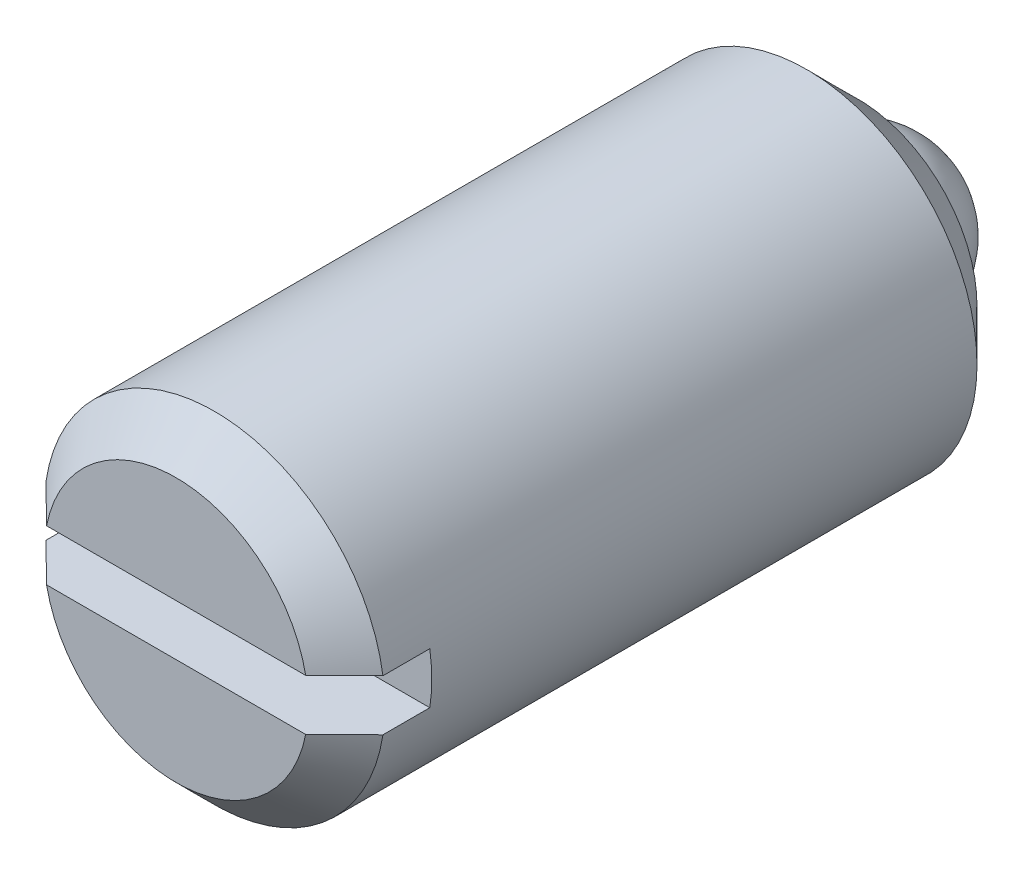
ISO-10303-21;
HEADER;
FILE_DESCRIPTION(('STEP AP214'),'2;1');
FILE_NAME('part.step','',(''),(''),'','','');
FILE_SCHEMA(('AUTOMOTIVE_DESIGN { 1 0 10303 214 1 1 1 1 }'));
ENDSEC;
DATA;
#1=APPLICATION_CONTEXT('core data for automotive mechanical design processes');
#2=APPLICATION_PROTOCOL_DEFINITION('international standard','automotive_design',2000,#1);
#3=PRODUCT_CONTEXT('',#1,'mechanical');
#4=PRODUCT('Part','Part','',(#3));
#5=PRODUCT_RELATED_PRODUCT_CATEGORY('part','',(#4));
#6=PRODUCT_DEFINITION_FORMATION('','',#4);
#7=PRODUCT_DEFINITION_CONTEXT('part definition',#1,'design');
#8=PRODUCT_DEFINITION('design','',#6,#7);
#9=PRODUCT_DEFINITION_SHAPE('','',#8);
#10=(LENGTH_UNIT() NAMED_UNIT(*) SI_UNIT(.MILLI.,.METRE.));
#11=(NAMED_UNIT(*) PLANE_ANGLE_UNIT() SI_UNIT($,.RADIAN.));
#12=(NAMED_UNIT(*) SI_UNIT($,.STERADIAN.) SOLID_ANGLE_UNIT());
#13=UNCERTAINTY_MEASURE_WITH_UNIT(LENGTH_MEASURE(1.E-05),#10,'distance_accuracy_value','');
#14=(GEOMETRIC_REPRESENTATION_CONTEXT(3) GLOBAL_UNCERTAINTY_ASSIGNED_CONTEXT((#13)) GLOBAL_UNIT_ASSIGNED_CONTEXT((#10,
#11,#12)) REPRESENTATION_CONTEXT('',''));
#15=CARTESIAN_POINT('',(0.,0.,0.));
#16=DIRECTION('',(0.,0.,1.));
#17=DIRECTION('',(1.,0.,0.));
#18=AXIS2_PLACEMENT_3D('',#15,#16,#17);
#19=CARTESIAN_POINT('',(0.,4.,18.));
#20=DIRECTION('',(0.,0.,1.));
#21=DIRECTION('',(1.,0.,0.));
#22=AXIS2_PLACEMENT_3D('',#19,#20,#21);
#23=PLANE('',#22);
#24=DIRECTION('',(1.,0.,0.));
#25=VECTOR('',#24,1.);
#26=CARTESIAN_POINT('',(-3.95474398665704,0.6,18.));
#27=LINE('',#26,#25);
#28=CARTESIAN_POINT('',(-3.04138126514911,0.6,18.));
#29=VERTEX_POINT('',#28);
#30=CARTESIAN_POINT('',(3.04138126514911,0.6,18.));
#31=VERTEX_POINT('',#30);
#32=EDGE_CURVE('E75',#29,#31,#27,.T.);
#33=ORIENTED_EDGE('',*,*,#32,.T.);
#34=CARTESIAN_POINT('',(0.,0.,18.));
#35=DIRECTION('',(0.,0.,1.));
#36=DIRECTION('',(0.,1.,0.));
#37=AXIS2_PLACEMENT_3D('',#34,#35,#36);
#38=CIRCLE('',#37,3.1);
#39=EDGE_CURVE('E9',#31,#29,#38,.T.);
#40=ORIENTED_EDGE('',*,*,#39,.T.);
#41=EDGE_LOOP('',(#33,#40));
#42=FACE_BOUND('',#41,.T.);
#43=ADVANCED_FACE('F14',(#42),#23,.T.);
#44=CARTESIAN_POINT('',(0.,0.,-8.));
#45=DIRECTION('',(0.,0.,-1.));
#46=DIRECTION('',(-1.,0.,0.));
#47=AXIS2_PLACEMENT_3D('',#44,#45,#46);
#48=CYLINDRICAL_SURFACE('',#47,4.);
#49=CARTESIAN_POINT('',(0.,0.,3.2));
#50=DIRECTION('',(0.,0.,-1.));
#51=DIRECTION('',(0.,-1.,0.));
#52=AXIS2_PLACEMENT_3D('',#49,#50,#51);
#53=CIRCLE('',#52,4.);
#54=CARTESIAN_POINT('',(0.,-4.,3.2));
#55=VERTEX_POINT('',#54);
#56=EDGE_CURVE('E104',#55,#55,#53,.F.);
#57=ORIENTED_EDGE('',*,*,#56,.T.);
#58=EDGE_LOOP('',(#57));
#59=FACE_BOUND('',#58,.T.);
#60=DIRECTION('',(0.,0.,1.));
#61=VECTOR('',#60,1.);
#62=CARTESIAN_POINT('',(3.95474398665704,-0.6,16.));
#63=LINE('',#62,#61);
#64=CARTESIAN_POINT('',(3.95474398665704,-0.6,16.));
#65=VERTEX_POINT('',#64);
#66=CARTESIAN_POINT('',(3.95474398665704,-0.6,17.1));
#67=VERTEX_POINT('',#66);
#68=EDGE_CURVE('E83',#65,#67,#63,.T.);
#69=ORIENTED_EDGE('',*,*,#68,.T.);
#70=CARTESIAN_POINT('',(0.,0.,17.1));
#71=DIRECTION('',(0.,0.,1.));
#72=DIRECTION('',(0.,1.,0.));
#73=AXIS2_PLACEMENT_3D('',#70,#71,#72);
#74=CIRCLE('',#73,4.);
#75=CARTESIAN_POINT('',(-3.95474398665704,-0.6,17.1));
#76=VERTEX_POINT('',#75);
#77=EDGE_CURVE('E89',#67,#76,#74,.F.);
#78=ORIENTED_EDGE('',*,*,#77,.T.);
#79=DIRECTION('',(0.,0.,1.));
#80=VECTOR('',#79,1.);
#81=CARTESIAN_POINT('',(-3.95474398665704,-0.6,16.));
#82=LINE('',#81,#80);
#83=CARTESIAN_POINT('',(-3.95474398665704,-0.6,16.));
#84=VERTEX_POINT('',#83);
#85=EDGE_CURVE('E81',#84,#76,#82,.T.);
#86=ORIENTED_EDGE('',*,*,#85,.F.);
#87=CARTESIAN_POINT('',(0.,0.,16.));
#88=DIRECTION('',(0.,0.,1.));
#89=DIRECTION('',(1.,0.,0.));
#90=AXIS2_PLACEMENT_3D('',#87,#88,#89);
#91=CIRCLE('',#90,4.);
#92=CARTESIAN_POINT('',(-3.95474398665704,0.6,16.));
#93=VERTEX_POINT('',#92);
#94=EDGE_CURVE('E65',#93,#84,#91,.T.);
#95=ORIENTED_EDGE('',*,*,#94,.F.);
#96=DIRECTION('',(0.,0.,1.));
#97=VECTOR('',#96,1.);
#98=CARTESIAN_POINT('',(-3.95474398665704,0.6,16.));
#99=LINE('',#98,#97);
#100=CARTESIAN_POINT('',(-3.95474398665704,0.6,17.1));
#101=VERTEX_POINT('',#100);
#102=EDGE_CURVE('E96',#93,#101,#99,.T.);
#103=ORIENTED_EDGE('',*,*,#102,.T.);
#104=CARTESIAN_POINT('',(0.,0.,17.1));
#105=DIRECTION('',(0.,0.,1.));
#106=DIRECTION('',(0.,1.,0.));
#107=AXIS2_PLACEMENT_3D('',#104,#105,#106);
#108=CIRCLE('',#107,4.);
#109=CARTESIAN_POINT('',(3.95474398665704,0.6,17.1));
#110=VERTEX_POINT('',#109);
#111=EDGE_CURVE('E107',#101,#110,#108,.F.);
#112=ORIENTED_EDGE('',*,*,#111,.T.);
#113=DIRECTION('',(0.,0.,1.));
#114=VECTOR('',#113,1.);
#115=CARTESIAN_POINT('',(3.95474398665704,0.6,16.));
#116=LINE('',#115,#114);
#117=CARTESIAN_POINT('',(3.95474398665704,0.6,16.));
#118=VERTEX_POINT('',#117);
#119=EDGE_CURVE('E91',#118,#110,#116,.T.);
#120=ORIENTED_EDGE('',*,*,#119,.F.);
#121=EDGE_CURVE('E77',#65,#118,#91,.T.);
#122=ORIENTED_EDGE('',*,*,#121,.F.);
#123=EDGE_LOOP('',(#69,#78,#86,#95,#103,#112,#120,#122));
#124=FACE_BOUND('',#123,.T.);
#125=ADVANCED_FACE('F87',(#59,#124),#48,.T.);
#126=CARTESIAN_POINT('',(0.,0.,2.));
#127=DIRECTION('',(-1.,0.,0.));
#128=DIRECTION('',(0.,0.,1.));
#129=AXIS2_PLACEMENT_3D('',#126,#127,#128);
#130=SPHERICAL_SURFACE('',#129,2.);
#131=CARTESIAN_POINT('',(0.,0.,2.));
#132=DIRECTION('',(0.,0.,-1.));
#133=DIRECTION('',(-1.,0.,0.));
#134=AXIS2_PLACEMENT_3D('',#131,#132,#133);
#135=SPHERICAL_SURFACE('',#134,2.);
#136=CARTESIAN_POINT('',(0.,0.,2.));
#137=DIRECTION('',(0.,0.,-1.));
#138=DIRECTION('',(-1.,0.,0.));
#139=AXIS2_PLACEMENT_3D('',#136,#137,#138);
#140=CIRCLE('',#139,2.);
#141=CARTESIAN_POINT('',(-2.,0.,2.));
#142=VERTEX_POINT('',#141);
#143=EDGE_CURVE('E98',#142,#142,#140,.T.);
#144=ORIENTED_EDGE('',*,*,#143,.T.);
#145=EDGE_LOOP('',(#144));
#146=FACE_BOUND('',#145,.T.);
#147=ADVANCED_FACE('F177',(#146),#135,.T.);
#148=DIRECTION('',(1.,0.,0.));
#149=VECTOR('',#148,1.);
#150=CARTESIAN_POINT('',(-3.95474398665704,-0.6,18.));
#151=LINE('',#150,#149);
#152=CARTESIAN_POINT('',(-3.04138126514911,-0.6,18.));
#153=VERTEX_POINT('',#152);
#154=CARTESIAN_POINT('',(3.04138126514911,-0.6,18.));
#155=VERTEX_POINT('',#154);
#156=EDGE_CURVE('E156',#153,#155,#151,.T.);
#157=ORIENTED_EDGE('',*,*,#156,.F.);
#158=CARTESIAN_POINT('',(0.,0.,18.));
#159=DIRECTION('',(0.,0.,1.));
#160=DIRECTION('',(0.,1.,0.));
#161=AXIS2_PLACEMENT_3D('',#158,#159,#160);
#162=CIRCLE('',#161,3.1);
#163=EDGE_CURVE('E150',#153,#155,#162,.T.);
#164=ORIENTED_EDGE('',*,*,#163,.T.);
#165=EDGE_LOOP('',(#157,#164));
#166=FACE_BOUND('',#165,.T.);
#167=ADVANCED_FACE('F159',(#166),#23,.T.);
#168=CARTESIAN_POINT('',(0.,2.,2.));
#169=DIRECTION('',(0.,0.,-1.));
#170=DIRECTION('',(-1.,0.,0.));
#171=AXIS2_PLACEMENT_3D('',#168,#169,#170);
#172=PLANE('',#171);
#173=CARTESIAN_POINT('',(0.,0.,2.));
#174=DIRECTION('',(0.,0.,-1.));
#175=DIRECTION('',(0.,-1.,0.));
#176=AXIS2_PLACEMENT_3D('',#173,#174,#175);
#177=CIRCLE('',#176,2.8);
#178=CARTESIAN_POINT('',(0.,-2.8,2.));
#179=VERTEX_POINT('',#178);
#180=EDGE_CURVE('E101',#179,#179,#177,.T.);
#181=ORIENTED_EDGE('',*,*,#180,.T.);
#182=EDGE_LOOP('',(#181));
#183=FACE_BOUND('',#182,.T.);
#184=ORIENTED_EDGE('',*,*,#143,.F.);
#185=EDGE_LOOP('',(#184));
#186=FACE_BOUND('',#185,.T.);
#187=ADVANCED_FACE('F137',(#183,#186),#172,.T.);
#188=CARTESIAN_POINT('',(-3.95474398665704,0.6,16.));
#189=DIRECTION('',(0.,-1.,0.));
#190=DIRECTION('',(1.,0.,0.));
#191=AXIS2_PLACEMENT_3D('',#188,#189,#190);
#192=PLANE('',#191);
#193=ORIENTED_EDGE('',*,*,#119,.T.);
#194=CARTESIAN_POINT('',(3.95474398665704,0.6,17.1));
#195=CARTESIAN_POINT('',(3.87875606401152,0.6,17.1751274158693));
#196=CARTESIAN_POINT('',(3.80274454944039,0.6,17.2502309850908));
#197=CARTESIAN_POINT('',(3.65066332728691,0.6,17.4003790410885));
#198=CARTESIAN_POINT('',(3.57459361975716,0.6,17.4754235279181));
#199=CARTESIAN_POINT('',(3.42238484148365,0.6,17.625442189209));
#200=CARTESIAN_POINT('',(3.34624577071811,0.6,17.7004163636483));
#201=CARTESIAN_POINT('',(3.19388188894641,0.6,17.8502776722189));
#202=CARTESIAN_POINT('',(3.11765707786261,0.6,17.9251648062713));
#203=CARTESIAN_POINT('',(3.04138126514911,0.6,18.));
#204=B_SPLINE_CURVE_WITH_KNOTS('',3,(#194,#195,#196,#197,#198,#199,#200,#201,#202,#203),
.UNSPECIFIED.,.F.,.F.,(4,2,2,2,4),(0.,0.32056924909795,0.641138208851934,0.96170726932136,
1.28227662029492),.UNSPECIFIED.);
#205=EDGE_CURVE('E23',#110,#31,#204,.T.);
#206=ORIENTED_EDGE('',*,*,#205,.T.);
#207=ORIENTED_EDGE('',*,*,#32,.F.);
#208=CARTESIAN_POINT('',(-3.04138126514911,0.6,18.));
#209=CARTESIAN_POINT('',(-3.11765707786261,0.6,17.9251648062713));
#210=CARTESIAN_POINT('',(-3.19388188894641,0.6,17.8502776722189));
#211=CARTESIAN_POINT('',(-3.34624577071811,0.6,17.7004163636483));
#212=CARTESIAN_POINT('',(-3.42238484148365,0.6,17.625442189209));
#213=CARTESIAN_POINT('',(-3.57459361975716,0.6,17.4754235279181));
#214=CARTESIAN_POINT('',(-3.65066332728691,0.6,17.4003790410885));
#215=CARTESIAN_POINT('',(-3.80274454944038,0.6,17.2502309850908));
#216=CARTESIAN_POINT('',(-3.87875606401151,0.6,17.1751274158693));
#217=CARTESIAN_POINT('',(-3.95474398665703,0.6,17.1));
#218=B_SPLINE_CURVE_WITH_KNOTS('',3,(#208,#209,#210,#211,#212,#213,#214,#215,#216,#217),
.UNSPECIFIED.,.F.,.F.,(4,2,2,2,4),(0.,0.320569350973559,0.641138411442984,0.961707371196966,
1.28227662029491),.UNSPECIFIED.);
#219=EDGE_CURVE('E141',#29,#101,#218,.T.);
#220=ORIENTED_EDGE('',*,*,#219,.T.);
#221=ORIENTED_EDGE('',*,*,#102,.F.);
#222=DIRECTION('',(1.,0.,0.));
#223=VECTOR('',#222,1.);
#224=CARTESIAN_POINT('',(-3.95474398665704,0.6,16.));
#225=LINE('',#224,#223);
#226=EDGE_CURVE('E71',#93,#118,#225,.T.);
#227=ORIENTED_EDGE('',*,*,#226,.T.);
#228=EDGE_LOOP('',(#193,#206,#207,#220,#221,#227));
#229=FACE_BOUND('',#228,.T.);
#230=ADVANCED_FACE('F131',(#229),#192,.T.);
#231=CARTESIAN_POINT('',(-3.95474398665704,-0.6,16.));
#232=DIRECTION('',(0.,-1.,0.));
#233=DIRECTION('',(1.,0.,0.));
#234=AXIS2_PLACEMENT_3D('',#231,#232,#233);
#235=PLANE('',#234);
#236=ORIENTED_EDGE('',*,*,#85,.T.);
#237=CARTESIAN_POINT('',(-3.95474398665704,-0.6,17.1));
#238=CARTESIAN_POINT('',(-3.87875606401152,-0.6,17.1751274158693));
#239=CARTESIAN_POINT('',(-3.80274454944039,-0.6,17.2502309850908));
#240=CARTESIAN_POINT('',(-3.65066332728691,-0.6,17.4003790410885));
#241=CARTESIAN_POINT('',(-3.57459361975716,-0.6,17.4754235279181));
#242=CARTESIAN_POINT('',(-3.42238484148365,-0.6,17.625442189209));
#243=CARTESIAN_POINT('',(-3.34624577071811,-0.6,17.7004163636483));
#244=CARTESIAN_POINT('',(-3.19388188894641,-0.6,17.8502776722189));
#245=CARTESIAN_POINT('',(-3.11765707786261,-0.6,17.9251648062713));
#246=CARTESIAN_POINT('',(-3.04138126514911,-0.6,18.));
#247=B_SPLINE_CURVE_WITH_KNOTS('',3,(#237,#238,#239,#240,#241,#242,#243,#244,#245,#246),
.UNSPECIFIED.,.F.,.F.,(4,2,2,2,4),(0.,0.32056924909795,0.641138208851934,0.96170726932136,
1.28227662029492),.UNSPECIFIED.);
#248=EDGE_CURVE('E118',#76,#153,#247,.T.);
#249=ORIENTED_EDGE('',*,*,#248,.T.);
#250=ORIENTED_EDGE('',*,*,#156,.T.);
#251=CARTESIAN_POINT('',(3.04138126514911,-0.6,18.));
#252=CARTESIAN_POINT('',(3.11765707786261,-0.6,17.9251648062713));
#253=CARTESIAN_POINT('',(3.19388188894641,-0.6,17.8502776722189));
#254=CARTESIAN_POINT('',(3.34624577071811,-0.6,17.7004163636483));
#255=CARTESIAN_POINT('',(3.42238484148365,-0.6,17.625442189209));
#256=CARTESIAN_POINT('',(3.57459361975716,-0.6,17.4754235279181));
#257=CARTESIAN_POINT('',(3.65066332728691,-0.6,17.4003790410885));
#258=CARTESIAN_POINT('',(3.80274454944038,-0.6,17.2502309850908));
#259=CARTESIAN_POINT('',(3.87875606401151,-0.6,17.1751274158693));
#260=CARTESIAN_POINT('',(3.95474398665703,-0.6,17.1));
#261=B_SPLINE_CURVE_WITH_KNOTS('',3,(#251,#252,#253,#254,#255,#256,#257,#258,#259,#260),
.UNSPECIFIED.,.F.,.F.,(4,2,2,2,4),(0.,0.320569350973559,0.641138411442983,0.961707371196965,
1.28227662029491),.UNSPECIFIED.);
#262=EDGE_CURVE('E111',#155,#67,#261,.T.);
#263=ORIENTED_EDGE('',*,*,#262,.T.);
#264=ORIENTED_EDGE('',*,*,#68,.F.);
#265=DIRECTION('',(1.,0.,0.));
#266=VECTOR('',#265,1.);
#267=CARTESIAN_POINT('',(-3.95474398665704,-0.6,16.));
#268=LINE('',#267,#266);
#269=EDGE_CURVE('E68',#84,#65,#268,.T.);
#270=ORIENTED_EDGE('',*,*,#269,.F.);
#271=EDGE_LOOP('',(#236,#249,#250,#263,#264,#270));
#272=FACE_BOUND('',#271,.T.);
#273=ADVANCED_FACE('F80',(#272),#235,.F.);
#274=CARTESIAN_POINT('',(0.,0.,16.));
#275=DIRECTION('',(0.,0.,1.));
#276=DIRECTION('',(1.,0.,0.));
#277=AXIS2_PLACEMENT_3D('',#274,#275,#276);
#278=PLANE('',#277);
#279=ORIENTED_EDGE('',*,*,#94,.T.);
#280=ORIENTED_EDGE('',*,*,#269,.T.);
#281=ORIENTED_EDGE('',*,*,#121,.T.);
#282=ORIENTED_EDGE('',*,*,#226,.F.);
#283=EDGE_LOOP('',(#279,#280,#281,#282));
#284=FACE_BOUND('',#283,.T.);
#285=ADVANCED_FACE('F67',(#284),#278,.T.);
#286=CARTESIAN_POINT('',(0.,0.,2.));
#287=DIRECTION('',(0.,0.,1.));
#288=DIRECTION('',(0.,1.,0.));
#289=AXIS2_PLACEMENT_3D('',#286,#287,#288);
#290=CONICAL_SURFACE('',#289,2.8,0.785398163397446);
#291=ORIENTED_EDGE('',*,*,#56,.F.);
#292=EDGE_LOOP('',(#291));
#293=FACE_BOUND('',#292,.T.);
#294=ORIENTED_EDGE('',*,*,#180,.F.);
#295=EDGE_LOOP('',(#294));
#296=FACE_BOUND('',#295,.T.);
#297=ADVANCED_FACE('F132',(#293,#296),#290,.T.);
#298=CARTESIAN_POINT('',(0.,0.,17.1));
#299=DIRECTION('',(0.,0.,-1.));
#300=DIRECTION('',(0.,-1.,0.));
#301=AXIS2_PLACEMENT_3D('',#298,#299,#300);
#302=CONICAL_SURFACE('',#301,4.,0.78539816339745);
#303=ORIENTED_EDGE('',*,*,#262,.F.);
#304=ORIENTED_EDGE('',*,*,#163,.F.);
#305=ORIENTED_EDGE('',*,*,#248,.F.);
#306=ORIENTED_EDGE('',*,*,#77,.F.);
#307=EDGE_LOOP('',(#303,#304,#305,#306));
#308=FACE_BOUND('',#307,.T.);
#309=ADVANCED_FACE('F124',(#308),#302,.T.);
#310=CARTESIAN_POINT('',(0.,0.,17.1));
#311=DIRECTION('',(0.,0.,-1.));
#312=DIRECTION('',(0.,-1.,0.));
#313=AXIS2_PLACEMENT_3D('',#310,#311,#312);
#314=CONICAL_SURFACE('',#313,4.,0.78539816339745);
#315=ORIENTED_EDGE('',*,*,#219,.F.);
#316=ORIENTED_EDGE('',*,*,#39,.F.);
#317=ORIENTED_EDGE('',*,*,#205,.F.);
#318=ORIENTED_EDGE('',*,*,#111,.F.);
#319=EDGE_LOOP('',(#315,#316,#317,#318));
#320=FACE_BOUND('',#319,.T.);
#321=ADVANCED_FACE('F16',(#320),#314,.T.);
#322=CLOSED_SHELL('',(#43,#125,#147,#167,#187,#230,#273,#285,#297,#309,#321));
#323=MANIFOLD_SOLID_BREP('B1',#322);
#324=ADVANCED_BREP_SHAPE_REPRESENTATION('',(#18,#323),#14);
#325=SHAPE_DEFINITION_REPRESENTATION(#9,#324);
ENDSEC;
END-ISO-10303-21;
